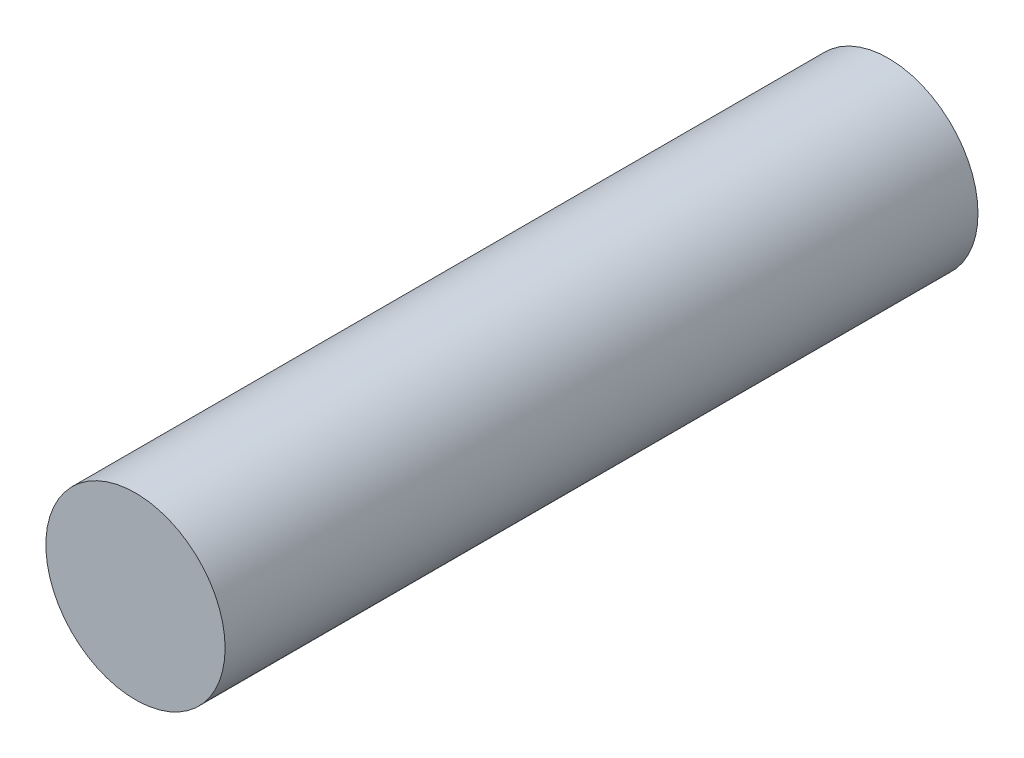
ISO-10303-21;
HEADER;
FILE_DESCRIPTION(('STEP AP214'),'2;1');
FILE_NAME('part.step','',(''),(''),'','','');
FILE_SCHEMA(('AUTOMOTIVE_DESIGN { 1 0 10303 214 1 1 1 1 }'));
ENDSEC;
DATA;
#1=APPLICATION_CONTEXT('core data for automotive mechanical design processes');
#2=APPLICATION_PROTOCOL_DEFINITION('international standard','automotive_design',2000,#1);
#3=PRODUCT_CONTEXT('',#1,'mechanical');
#4=PRODUCT('Part','Part','',(#3));
#5=PRODUCT_RELATED_PRODUCT_CATEGORY('part','',(#4));
#6=PRODUCT_DEFINITION_FORMATION('','',#4);
#7=PRODUCT_DEFINITION_CONTEXT('part definition',#1,'design');
#8=PRODUCT_DEFINITION('design','',#6,#7);
#9=PRODUCT_DEFINITION_SHAPE('','',#8);
#10=(LENGTH_UNIT() NAMED_UNIT(*) SI_UNIT(.MILLI.,.METRE.));
#11=(NAMED_UNIT(*) PLANE_ANGLE_UNIT() SI_UNIT($,.RADIAN.));
#12=(NAMED_UNIT(*) SI_UNIT($,.STERADIAN.) SOLID_ANGLE_UNIT());
#13=UNCERTAINTY_MEASURE_WITH_UNIT(LENGTH_MEASURE(1.E-05),#10,'distance_accuracy_value','');
#14=(GEOMETRIC_REPRESENTATION_CONTEXT(3) GLOBAL_UNCERTAINTY_ASSIGNED_CONTEXT((#13)) GLOBAL_UNIT_ASSIGNED_CONTEXT((#10,
#11,#12)) REPRESENTATION_CONTEXT('',''));
#15=CARTESIAN_POINT('',(0.,0.,0.));
#16=DIRECTION('',(0.,0.,1.));
#17=DIRECTION('',(1.,0.,0.));
#18=AXIS2_PLACEMENT_3D('',#15,#16,#17);
#19=CARTESIAN_POINT('',(0.,0.,4.2));
#20=DIRECTION('',(0.,0.,-1.));
#21=DIRECTION('',(-1.,0.,0.));
#22=AXIS2_PLACEMENT_3D('',#19,#20,#21);
#23=CYLINDRICAL_SURFACE('',#22,1.);
#24=CARTESIAN_POINT('',(0.,0.,4.2));
#25=DIRECTION('',(0.,0.,1.));
#26=DIRECTION('',(1.,0.,0.));
#27=AXIS2_PLACEMENT_3D('',#24,#25,#26);
#28=CIRCLE('',#27,1.);
#29=CARTESIAN_POINT('',(1.,0.,4.2));
#30=VERTEX_POINT('',#29);
#31=EDGE_CURVE('E10',#30,#30,#28,.T.);
#32=ORIENTED_EDGE('',*,*,#31,.F.);
#33=EDGE_LOOP('',(#32));
#34=FACE_BOUND('',#33,.T.);
#35=CARTESIAN_POINT('',(0.,0.,-4.2));
#36=DIRECTION('',(0.,0.,1.));
#37=DIRECTION('',(1.,0.,0.));
#38=AXIS2_PLACEMENT_3D('',#35,#36,#37);
#39=CIRCLE('',#38,1.);
#40=CARTESIAN_POINT('',(1.,0.,-4.2));
#41=VERTEX_POINT('',#40);
#42=EDGE_CURVE('E33',#41,#41,#39,.T.);
#43=ORIENTED_EDGE('',*,*,#42,.T.);
#44=EDGE_LOOP('',(#43));
#45=FACE_BOUND('',#44,.T.);
#46=ADVANCED_FACE('F30',(#34,#45),#23,.T.);
#47=CARTESIAN_POINT('',(0.,0.,4.2));
#48=DIRECTION('',(0.,0.,1.));
#49=DIRECTION('',(1.,0.,0.));
#50=AXIS2_PLACEMENT_3D('',#47,#48,#49);
#51=PLANE('',#50);
#52=ORIENTED_EDGE('',*,*,#31,.T.);
#53=EDGE_LOOP('',(#52));
#54=FACE_BOUND('',#53,.T.);
#55=ADVANCED_FACE('F45',(#54),#51,.T.);
#56=CARTESIAN_POINT('',(0.,0.,-4.2));
#57=DIRECTION('',(0.,0.,1.));
#58=DIRECTION('',(1.,0.,0.));
#59=AXIS2_PLACEMENT_3D('',#56,#57,#58);
#60=PLANE('',#59);
#61=ORIENTED_EDGE('',*,*,#42,.F.);
#62=EDGE_LOOP('',(#61));
#63=FACE_BOUND('',#62,.T.);
#64=ADVANCED_FACE('F43',(#63),#60,.F.);
#65=CLOSED_SHELL('',(#46,#55,#64));
#66=MANIFOLD_SOLID_BREP('B2',#65);
#67=ADVANCED_BREP_SHAPE_REPRESENTATION('',(#18,#66),#14);
#68=SHAPE_DEFINITION_REPRESENTATION(#9,#67);
ENDSEC;
END-ISO-10303-21;
